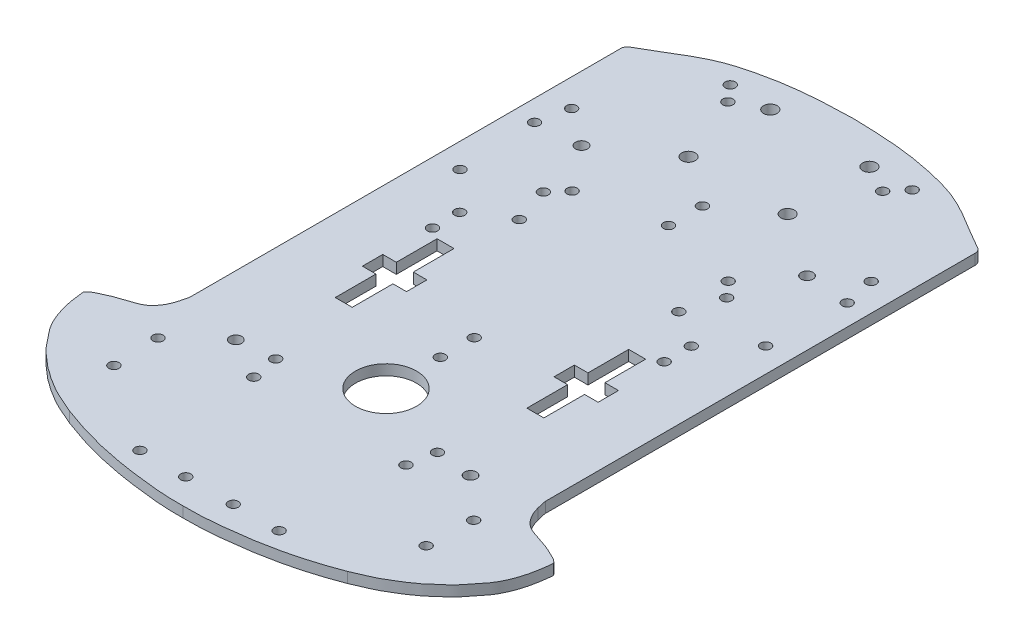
from build123d import *

# Parameters (mm, degrees)
SKETCH1_R           = 9
BOSS_EXTRUDE1_DEPTH = 3.1
CUT_EXTRUDE1_DEPTH  = 165.680364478
SKETCH3_R           = 2
SKETCH3_R_2         = 1.5
SKETCH3_R_3         = 1.75
CUT_EXTRUDE2_DEPTH  = 165.680364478


with BuildPart() as part:
    # Sketch1 → Boss-Extrude1 (new body)
    with BuildSketch(Plane(origin=(0, 0, 0), x_dir=(1, 0, 0), z_dir=(0, 1, 0))):
        with BuildLine():
            Line((-45.629862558, 8.35619015), (-45.629862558, 129.126692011))
            Line((-45.629862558, 129.126692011), (-45.629862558, 129.727785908))
            ThreePointArc((-45.629862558, 129.727785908), (-45.355212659, 130.739303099), (-44.60669553, 131.473007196))
            Line((-44.60669553, 131.473007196), (-43.775900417, 131.938018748))
            add(Edge.make_bspline(
                [(6.59713878, 146.132904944), (0.875095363, 145.976666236), (-7.590839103, 145.715732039), (-19.052161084, 143.571257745), (-30.756000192, 140.462457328), (-38.455108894, 134.823556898), (-43.775900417, 131.938018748)],
                knots=[0, 0, 0, 0, 0.323136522, 0.474437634, 0.657027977, 1, 1, 1, 1], degree=3))
            add(Edge.make_bspline(
                [(6.59713878, 146.132904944), (12.319182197, 145.976666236), (20.785116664, 145.715732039), (32.246438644, 143.571257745), (43.950277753, 140.462457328), (51.649386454, 134.823556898), (56.970177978, 131.938018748)],
                knots=[0, 0, 0, 0, 0.323136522, 0.474437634, 0.657027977, 1, 1, 1, 1], degree=3))
            Line((56.970177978, 131.938018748), (57.800973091, 131.473007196))
            ThreePointArc((57.800973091, 131.473007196), (58.54949022, 130.739303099), (58.824140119, 129.727785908))
            Line((58.824140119, 129.727785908), (58.824140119, 129.126692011))
            Line((58.824140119, 129.126692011), (58.824140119, 8.35619015))
            Line((58.824140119, 8.35619015), (58.824140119, 3.138521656))
            add(Edge.make_bspline(
                [(59.422544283, 0.335269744), (59.244172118, 1.275106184), (58.876826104, 2.17380542), (58.824140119, 3.138521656)],
                knots=[0, 0, 0, 0, 1, 1, 1, 1], degree=3))
            add(Edge.make_bspline(
                [(75.862945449, -11.518190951), (75.049613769, -10.45436874), (73.151587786, -9.725788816), (70.737191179, -8.499603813), (68.712769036, -7.856828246), (66.777496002, -7.11733583), (64.90077019, -6.601723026), (63.169558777, -5.729209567), (60.897924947, -3.663849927), (59.855908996, -1.36373619), (59.422544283, 0.335269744)],
                knots=[0, 0, 0, 0, 0.182315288, 0.279995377, 0.38266414, 0.480932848, 0.572284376, 0.656662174, 0.751766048, 1, 1, 1, 1], degree=3))
            add(Edge.make_bspline(
                [(75.862945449, -11.518190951), (75.741024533, -12.832614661), (75.460578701, -14.908961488), (74.932809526, -17.749154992), (74.221390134, -20.189332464), (73.171958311, -22.942131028), (71.446537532, -26.163144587), (69.249422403, -28.421778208), (67.548537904, -30.833338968), (65.802203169, -32.758065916), (63.583091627, -34.343291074), (62.015236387, -36.029800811), (60.417973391, -36.929256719), (58.904100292, -38.235764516), (57.186382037, -39.137200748), (55.554444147, -40.234391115), (53.818895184, -41.179520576), (51.11227359, -42.419552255), (48.981820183, -43.312444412), (47.594017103, -43.922181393)],
                knots=[0, 0, 0, 0, 0.086921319, 0.137992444, 0.19011877, 0.254073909, 0.33199486, 0.428709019, 0.459953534, 0.526386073, 0.598566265, 0.639017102, 0.676812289, 0.718334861, 0.770194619, 0.803932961, 0.847850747, 0.900151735, 1, 1, 1, 1], degree=3))
            add(Edge.make_bspline(
                [(47.594017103, -43.922181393), (45.550919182, -44.627509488), (42.343171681, -45.890493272), (37.607289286, -47.228707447), (33.558977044, -48.333210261), (29.446853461, -49.126602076), (25.262659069, -49.961620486), (20.865348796, -50.490904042), (14.574542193, -51.296608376), (9.78435241, -51.513322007), (6.59713878, -51.460192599)],
                knots=[0, 0, 0, 0, 0.15477778, 0.24635532, 0.352136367, 0.455017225, 0.546020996, 0.657453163, 0.771873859, 1, 1, 1, 1], degree=3))
            add(Edge.make_bspline(
                [(-34.399739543, -43.922181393), (-32.356641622, -44.627509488), (-29.14889412, -45.890493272), (-24.413011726, -47.228707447), (-20.364699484, -48.333210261), (-16.2525759, -49.126602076), (-12.068381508, -49.961620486), (-7.671071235, -50.490904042), (-1.380264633, -51.296608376), (3.40992515, -51.513322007), (6.59713878, -51.460192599)],
                knots=[0, 0, 0, 0, 0.15477778, 0.24635532, 0.352136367, 0.455017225, 0.546020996, 0.657453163, 0.771873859, 1, 1, 1, 1], degree=3))
            add(Edge.make_bspline(
                [(-62.668667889, -11.518190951), (-62.546746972, -12.832614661), (-62.26630114, -14.908961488), (-61.738531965, -17.749154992), (-61.027112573, -20.189332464), (-59.977680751, -22.942131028), (-58.252259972, -26.163144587), (-56.055144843, -28.421778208), (-54.354260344, -30.833338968), (-52.607925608, -32.758065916), (-50.388814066, -34.343291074), (-48.820958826, -36.029800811), (-47.22369583, -36.929256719), (-45.709822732, -38.235764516), (-43.992104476, -39.137200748), (-42.360166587, -40.234391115), (-40.624617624, -41.179520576), (-37.91799603, -42.419552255), (-35.787542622, -43.312444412), (-34.399739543, -43.922181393)],
                knots=[0, 0, 0, 0, 0.086921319, 0.137992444, 0.19011877, 0.254073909, 0.33199486, 0.428709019, 0.459953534, 0.526386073, 0.598566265, 0.639017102, 0.676812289, 0.718334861, 0.770194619, 0.803932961, 0.847850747, 0.900151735, 1, 1, 1, 1], degree=3))
            add(Edge.make_bspline(
                [(-62.668667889, -11.518190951), (-61.855336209, -10.45436874), (-59.957310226, -9.725788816), (-57.542913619, -8.499603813), (-55.518491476, -7.856828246), (-53.583218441, -7.11733583), (-51.706492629, -6.601723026), (-49.975281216, -5.729209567), (-47.703647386, -3.663849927), (-46.661631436, -1.36373619), (-46.228266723, 0.335269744)],
                knots=[0, 0, 0, 0, 0.182315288, 0.279995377, 0.38266414, 0.480932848, 0.572284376, 0.656662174, 0.751766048, 1, 1, 1, 1], degree=3))
            add(Edge.make_bspline(
                [(-46.228266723, 0.335269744), (-46.049894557, 1.275106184), (-45.682548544, 2.17380542), (-45.629862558, 3.138521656)],
                knots=[0, 0, 0, 0, 1, 1, 1, 1], degree=3))
            Line((-45.629862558, 3.138521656), (-45.629862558, 8.35619015))
        make_face()
        with Locations(Location((6.59713878, 8.356190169, 0), (0, 0, 90))):
            Circle(SKETCH1_R, mode=Mode.SUBTRACT)
    extrude(amount=BOSS_EXTRUDE1_DEPTH)

    # Sketch2 → Cut-Extrude1 (cut, through all)
    with BuildSketch(Plane(origin=(0, 3.1, 0), x_dir=(1, 0, 0), z_dir=(0, 1, 0))):
        Polygon((32.324140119, 42.132904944), (28.324140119, 42.132904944), (28.324140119, 36.132904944), (32.324140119, 36.132904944), (32.324140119, 24.132904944), (37.324140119, 24.132904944), (37.324140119, 36.132904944), (41.324140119, 36.132904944), (41.324140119, 42.132904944), (37.324140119, 42.132904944), (37.324140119, 54.132904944), (32.324140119, 54.132904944), align=None)
        Polygon((-24.129862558, 54.132904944), (-24.129862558, 42.132904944), (-28.129862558, 42.132904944), (-28.129862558, 36.132904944), (-24.129862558, 36.132904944), (-24.129862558, 24.132904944), (-19.129862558, 24.132904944), (-19.129862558, 36.132904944), (-15.129862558, 36.132904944), (-15.129862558, 42.132904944), (-19.129862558, 42.132904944), (-19.129862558, 54.132904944), align=None)
    extrude(amount=-CUT_EXTRUDE1_DEPTH, mode=Mode.SUBTRACT)

    # Sketch3 → Cut-Extrude2 (cut, through all)
    with BuildSketch(Plane(origin=(0, 3.1, 0), x_dir=(1, 0, 0), z_dir=(0, 1, 0))):
        with Locations(Location((-8.00286122, 136.186066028, 0), (0, 0, 270))):
            Circle(SKETCH3_R)
        with Locations(Location((-20.20286122, 136.586066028, 0), (0, 0, 270))):
            Circle(SKETCH3_R_2)
        with Locations(Location((-16.20286122, 131.886066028, 0), (0, 0, 270))):
            Circle(SKETCH3_R_2)
        with Locations(Location((-8.00286122, 112.086066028, 0), (0, 0, 270))):
            Circle(SKETCH3_R)
        with Locations(Location((-37.529862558, 107.186066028, 0), (0, 0, 270))):
            Circle(SKETCH3_R_2)
        with Locations(Location((-39.459862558, 98.186066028, 0), (0, 0, 270))):
            Circle(SKETCH3_R_2)
        with Locations(Location((-26.629862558, 99.186066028, 0), (0, 0, 270))):
            Circle(SKETCH3_R_3)
        with Locations(Location((6.59713878, 101.586066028, 0), (0, 0, 270))):
            Circle(SKETCH3_R_2)
        with Locations(Location((6.59713878, 91.586066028, 0), (0, 0, 270))):
            Circle(SKETCH3_R_2)
        with Locations(Location((21.19713878, 136.186066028, 0), (0, 0, 270))):
            Circle(SKETCH3_R)
        with Locations(Location((33.39713878, 136.586066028, 0), (0, 0, 270))):
            Circle(SKETCH3_R_2)
        with Locations(Location((29.39713878, 131.886066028, 0), (0, 0, 270))):
            Circle(SKETCH3_R_2)
        with Locations(Location((21.19713878, 112.086066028, 0), (0, 0, 270))):
            Circle(SKETCH3_R)
        with Locations(Location((39.824140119, 99.186066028, 0), (0, 0, 270))):
            Circle(SKETCH3_R_3)
        with Locations(Location((52.654140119, 98.186066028, 0), (0, 0, 270))):
            Circle(SKETCH3_R_2)
        with Locations(Location((50.724140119, 107.186066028, 0), (0, 0, 270))):
            Circle(SKETCH3_R_2)
        with Locations(Location((-16.40286122, 86.186066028, 0), (0, 0, 270))):
            Circle(SKETCH3_R_2)
        with Locations(Location((-20.40286122, 81.713930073, 0), (0, 0, 270))):
            Circle(SKETCH3_R_2)
        with Locations(Location((-38.429862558, 75.186066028, 0), (0, 0, 270))):
            Circle(SKETCH3_R_2)
        with Locations(Location((-27.529862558, 56.186066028, 0), (0, 0, 270))):
            Circle(SKETCH3_R_2)
        with Locations(Location((-27.529862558, 64.186066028, 0), (0, 0, 270))):
            Circle(SKETCH3_R_2)
        with Locations(Location((-16.90286122, 71.132904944, 0), (0, 0, 270))):
            Circle(SKETCH3_R_2)
        with Locations(Location((30.09713878, 71.132904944, 0), (0, 0, 270))):
            Circle(SKETCH3_R_2)
        with Locations(Location((29.59713878, 86.186066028, 0), (0, 0, 270))):
            Circle(SKETCH3_R_2)
        with Locations(Location((33.59713878, 81.713930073, 0), (0, 0, 270))):
            Circle(SKETCH3_R_2)
        with Locations(Location((51.624140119, 75.186066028, 0), (0, 0, 270))):
            Circle(SKETCH3_R_2)
        with Locations(Location((40.724140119, 64.186066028, 0), (0, 0, 270))):
            Circle(SKETCH3_R_2)
        with Locations(Location((40.724140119, 56.186066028, 0), (0, 0, 270))):
            Circle(SKETCH3_R_2)
        with Locations(Location((-27.979862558, -1.313933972, 0), (0, 0, 270))):
            Circle(SKETCH3_R_3)
        with Locations(Location((-17.229862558, -0.313933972, 0), (0, 0, 270))):
            Circle(SKETCH3_R_2)
        with Locations(Location((-15.817714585, -8.188312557, 0), (0, 0, 270))):
            Circle(SKETCH3_R_2)
        with Locations(Location((-39.90286122, -12.313933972, 0), (0, 0, 270))):
            Circle(SKETCH3_R_2)
        with Locations(Location((-39.40286122, -25.813933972, 0), (0, 0, 270))):
            Circle(SKETCH3_R_2)
        with Locations(Location((6.59713878, 24.356190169, 0), (0, 0, 270))):
            Circle(SKETCH3_R_2)
        with Locations(Location((6.59713878, 34.356190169, 0), (0, 0, 270))):
            Circle(SKETCH3_R_2)
        with Locations(Location((-13.90286122, -43.643809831, 0), (0, 0, 270))):
            Circle(SKETCH3_R_2)
        with Locations(Location((-0.40286122, -43.643809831, 0), (0, 0, 270))):
            Circle(SKETCH3_R_2)
        with Locations(Location((13.59713878, -43.643809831, 0), (0, 0, 270))):
            Circle(SKETCH3_R_2)
        with Locations(Location((27.09713878, -43.643809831, 0), (0, 0, 270))):
            Circle(SKETCH3_R_2)
        with Locations(Location((52.59713878, -25.813933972, 0), (0, 0, 270))):
            Circle(SKETCH3_R_2)
        with Locations(Location((53.09713878, -12.313933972, 0), (0, 0, 270))):
            Circle(SKETCH3_R_2)
        with Locations(Location((29.011992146, -8.188312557, 0), (0, 0, 270))):
            Circle(SKETCH3_R_2)
        with Locations(Location((41.174140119, -1.313933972, 0), (0, 0, 270))):
            Circle(SKETCH3_R_3)
        with Locations(Location((30.424140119, -0.313933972, 0), (0, 0, 270))):
            Circle(SKETCH3_R_2)
    extrude(amount=-CUT_EXTRUDE2_DEPTH, mode=Mode.SUBTRACT)


solid = part.part
